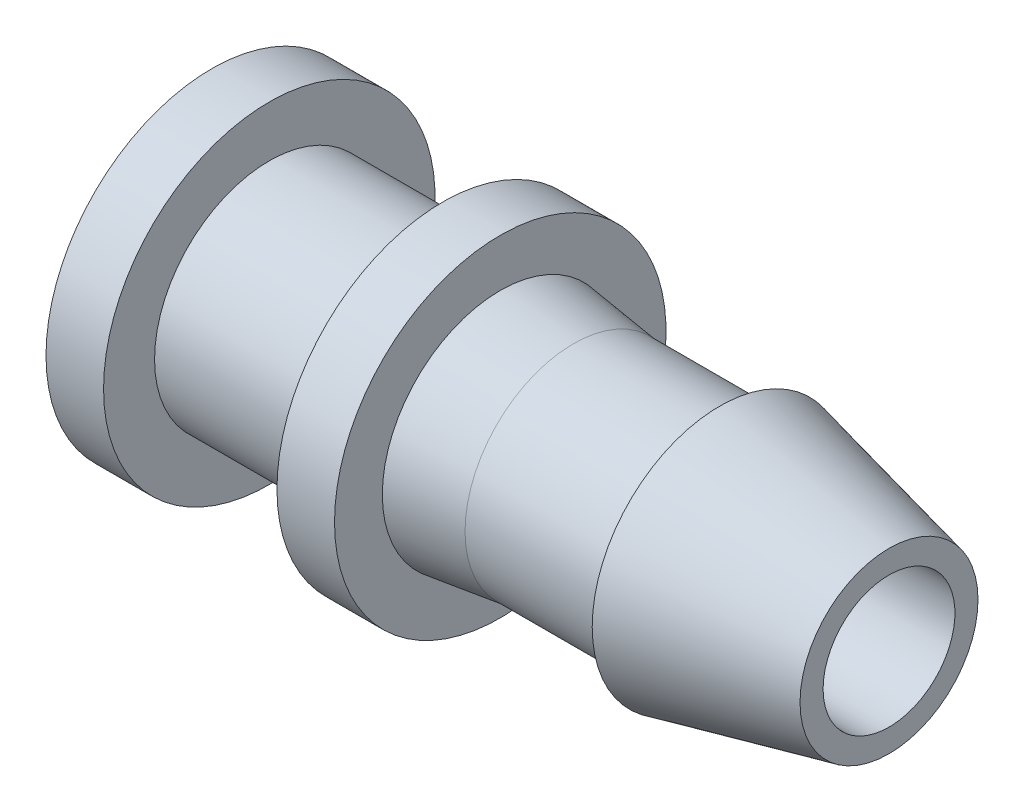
from build123d import *


with BuildPart() as part:
    # Sketch1 → Revolve1 (revolve)
    with BuildSketch(Plane.XY, mode=Mode.PRIVATE) as revolve1_sk:
        Polygon((18.690463, 2.3114), (18.690463, 3.12039), (12.753213, 4.4704), (12.753213, 3.79984), (7.623429, 3.79984), (5.058537, 4.13512), (5.058537, 5.81152), (3.039872, 5.81152), (3.039872, 4.02336), (-3.039872, 4.02336), (-3.039872, 5.81152), (-5.058537, 5.81152), (-5.058537, 0), (-3.039872, 0), (-3.039872, 2.3114), align=None)
    revolve(revolve1_sk.sketch.rotate(Axis((0, 0, 0), (1, 0, 0)), 90), axis=Axis((0, 0, 0), (1, 0, 0)))


solid = part.part
